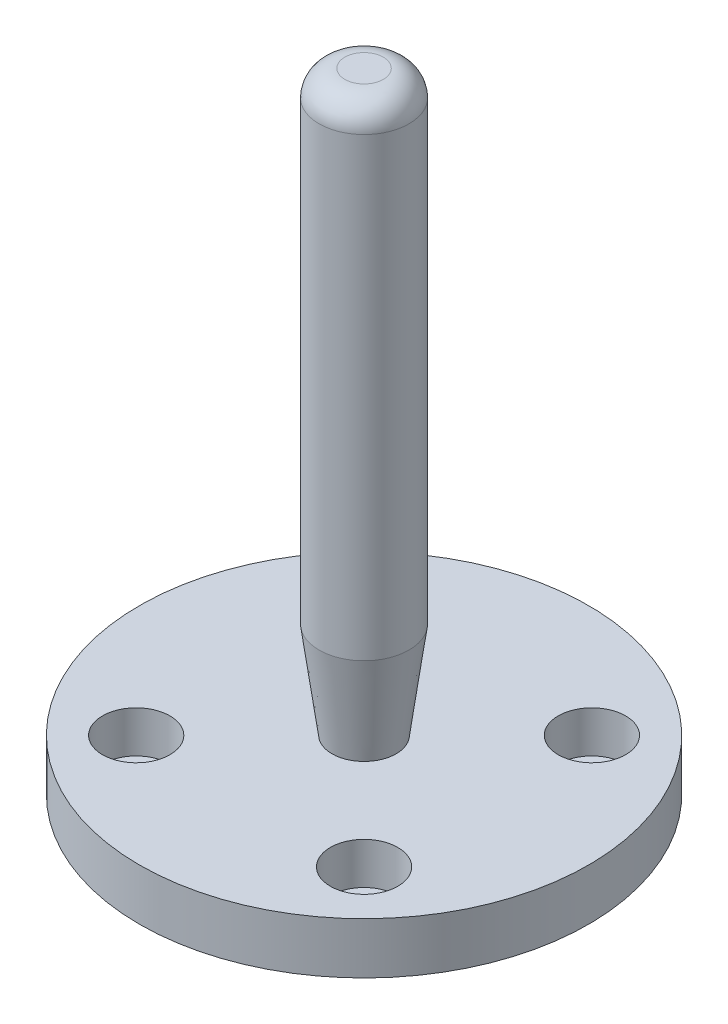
ISO-10303-21;
HEADER;
FILE_DESCRIPTION(('STEP AP214'),'2;1');
FILE_NAME('part.step','',(''),(''),'','','');
FILE_SCHEMA(('AUTOMOTIVE_DESIGN { 1 0 10303 214 1 1 1 1 }'));
ENDSEC;
DATA;
#1=APPLICATION_CONTEXT('core data for automotive mechanical design processes');
#2=APPLICATION_PROTOCOL_DEFINITION('international standard','automotive_design',2000,#1);
#3=PRODUCT_CONTEXT('',#1,'mechanical');
#4=PRODUCT('Part','Part','',(#3));
#5=PRODUCT_RELATED_PRODUCT_CATEGORY('part','',(#4));
#6=PRODUCT_DEFINITION_FORMATION('','',#4);
#7=PRODUCT_DEFINITION_CONTEXT('part definition',#1,'design');
#8=PRODUCT_DEFINITION('design','',#6,#7);
#9=PRODUCT_DEFINITION_SHAPE('','',#8);
#10=(LENGTH_UNIT() NAMED_UNIT(*) SI_UNIT(.MILLI.,.METRE.));
#11=(NAMED_UNIT(*) PLANE_ANGLE_UNIT() SI_UNIT($,.RADIAN.));
#12=(NAMED_UNIT(*) SI_UNIT($,.STERADIAN.) SOLID_ANGLE_UNIT());
#13=UNCERTAINTY_MEASURE_WITH_UNIT(LENGTH_MEASURE(1.E-05),#10,'distance_accuracy_value','');
#14=(GEOMETRIC_REPRESENTATION_CONTEXT(3) GLOBAL_UNCERTAINTY_ASSIGNED_CONTEXT((#13)) GLOBAL_UNIT_ASSIGNED_CONTEXT((#10,
#11,#12)) REPRESENTATION_CONTEXT('',''));
#15=CARTESIAN_POINT('',(0.,0.,0.));
#16=DIRECTION('',(0.,0.,1.));
#17=DIRECTION('',(1.,0.,0.));
#18=AXIS2_PLACEMENT_3D('',#15,#16,#17);
#19=CARTESIAN_POINT('',(0.,8.,0.));
#20=DIRECTION('',(0.,-1.,0.));
#21=DIRECTION('',(0.,0.,-1.));
#22=AXIS2_PLACEMENT_3D('',#19,#20,#21);
#23=CYLINDRICAL_SURFACE('',#22,35.);
#24=CARTESIAN_POINT('',(0.,8.,0.));
#25=DIRECTION('',(0.,1.,0.));
#26=DIRECTION('',(0.,0.,1.));
#27=AXIS2_PLACEMENT_3D('',#24,#25,#26);
#28=CIRCLE('',#27,35.);
#29=CARTESIAN_POINT('',(0.,8.,35.));
#30=VERTEX_POINT('',#29);
#31=EDGE_CURVE('E48',#30,#30,#28,.T.);
#32=ORIENTED_EDGE('',*,*,#31,.F.);
#33=EDGE_LOOP('',(#32));
#34=FACE_BOUND('',#33,.T.);
#35=CARTESIAN_POINT('',(0.,0.,0.));
#36=DIRECTION('',(0.,1.,0.));
#37=DIRECTION('',(0.,0.,1.));
#38=AXIS2_PLACEMENT_3D('',#35,#36,#37);
#39=CIRCLE('',#38,35.);
#40=CARTESIAN_POINT('',(0.,0.,35.));
#41=VERTEX_POINT('',#40);
#42=EDGE_CURVE('E51',#41,#41,#39,.T.);
#43=ORIENTED_EDGE('',*,*,#42,.T.);
#44=EDGE_LOOP('',(#43));
#45=FACE_BOUND('',#44,.T.);
#46=ADVANCED_FACE('F33',(#34,#45),#23,.T.);
#47=CARTESIAN_POINT('',(0.,8.,0.));
#48=DIRECTION('',(0.,1.,0.));
#49=DIRECTION('',(0.,0.,1.));
#50=AXIS2_PLACEMENT_3D('',#47,#48,#49);
#51=PLANE('',#50);
#52=CARTESIAN_POINT('',(0.,8.,0.));
#53=DIRECTION('',(0.,1.,0.));
#54=DIRECTION('',(0.,0.,1.));
#55=AXIS2_PLACEMENT_3D('',#52,#53,#54);
#56=CIRCLE('',#55,5.);
#57=CARTESIAN_POINT('',(0.,8.,5.));
#58=VERTEX_POINT('',#57);
#59=EDGE_CURVE('E44',#58,#58,#56,.T.);
#60=ORIENTED_EDGE('',*,*,#59,.F.);
#61=EDGE_LOOP('',(#60));
#62=FACE_BOUND('',#61,.T.);
#63=CARTESIAN_POINT('',(-17.75,8.,17.75));
#64=DIRECTION('',(0.,1.,0.));
#65=DIRECTION('',(0.,0.,1.));
#66=AXIS2_PLACEMENT_3D('',#63,#64,#65);
#67=CIRCLE('',#66,5.25);
#68=CARTESIAN_POINT('',(-17.75,8.,23.));
#69=VERTEX_POINT('',#68);
#70=EDGE_CURVE('E75',#69,#69,#67,.T.);
#71=ORIENTED_EDGE('',*,*,#70,.F.);
#72=EDGE_LOOP('',(#71));
#73=FACE_BOUND('',#72,.T.);
#74=CARTESIAN_POINT('',(17.75,8.,17.75));
#75=DIRECTION('',(0.,1.,0.));
#76=DIRECTION('',(0.,0.,1.));
#77=AXIS2_PLACEMENT_3D('',#74,#75,#76);
#78=CIRCLE('',#77,5.25);
#79=CARTESIAN_POINT('',(17.75,8.,23.));
#80=VERTEX_POINT('',#79);
#81=EDGE_CURVE('E69',#80,#80,#78,.T.);
#82=ORIENTED_EDGE('',*,*,#81,.F.);
#83=EDGE_LOOP('',(#82));
#84=FACE_BOUND('',#83,.T.);
#85=CARTESIAN_POINT('',(17.75,8.,-17.75));
#86=DIRECTION('',(0.,1.,0.));
#87=DIRECTION('',(0.,0.,1.));
#88=AXIS2_PLACEMENT_3D('',#85,#86,#87);
#89=CIRCLE('',#88,5.25);
#90=CARTESIAN_POINT('',(17.75,8.,-12.5));
#91=VERTEX_POINT('',#90);
#92=EDGE_CURVE('E63',#91,#91,#89,.T.);
#93=ORIENTED_EDGE('',*,*,#92,.F.);
#94=EDGE_LOOP('',(#93));
#95=FACE_BOUND('',#94,.T.);
#96=CARTESIAN_POINT('',(-17.75,8.,-17.75));
#97=DIRECTION('',(0.,1.,0.));
#98=DIRECTION('',(0.,0.,1.));
#99=AXIS2_PLACEMENT_3D('',#96,#97,#98);
#100=CIRCLE('',#99,5.25);
#101=CARTESIAN_POINT('',(-17.75,8.,-12.5));
#102=VERTEX_POINT('',#101);
#103=EDGE_CURVE('E57',#102,#102,#100,.T.);
#104=ORIENTED_EDGE('',*,*,#103,.F.);
#105=EDGE_LOOP('',(#104));
#106=FACE_BOUND('',#105,.T.);
#107=ORIENTED_EDGE('',*,*,#31,.T.);
#108=EDGE_LOOP('',(#107));
#109=FACE_BOUND('',#108,.T.);
#110=ADVANCED_FACE('F123',(#62,#73,#84,#95,#106,#109),#51,.T.);
#111=CARTESIAN_POINT('',(0.,0.,0.));
#112=DIRECTION('',(0.,1.,0.));
#113=DIRECTION('',(0.,0.,1.));
#114=AXIS2_PLACEMENT_3D('',#111,#112,#113);
#115=PLANE('',#114);
#116=CARTESIAN_POINT('',(17.75,0.,17.75));
#117=DIRECTION('',(0.,1.,0.));
#118=DIRECTION('',(0.,0.,1.));
#119=AXIS2_PLACEMENT_3D('',#116,#117,#118);
#120=CIRCLE('',#119,3.25);
#121=CARTESIAN_POINT('',(17.75,0.,21.));
#122=VERTEX_POINT('',#121);
#123=EDGE_CURVE('E98',#122,#122,#120,.T.);
#124=ORIENTED_EDGE('',*,*,#123,.T.);
#125=EDGE_LOOP('',(#124));
#126=FACE_BOUND('',#125,.T.);
#127=CARTESIAN_POINT('',(-17.75,0.,17.75));
#128=DIRECTION('',(0.,1.,0.));
#129=DIRECTION('',(0.,0.,1.));
#130=AXIS2_PLACEMENT_3D('',#127,#128,#129);
#131=CIRCLE('',#130,3.25);
#132=CARTESIAN_POINT('',(-17.75,0.,21.));
#133=VERTEX_POINT('',#132);
#134=EDGE_CURVE('E92',#133,#133,#131,.T.);
#135=ORIENTED_EDGE('',*,*,#134,.T.);
#136=EDGE_LOOP('',(#135));
#137=FACE_BOUND('',#136,.T.);
#138=CARTESIAN_POINT('',(-17.75,0.,-17.75));
#139=DIRECTION('',(0.,1.,0.));
#140=DIRECTION('',(0.,0.,1.));
#141=AXIS2_PLACEMENT_3D('',#138,#139,#140);
#142=CIRCLE('',#141,3.25);
#143=CARTESIAN_POINT('',(-17.75,0.,-14.5));
#144=VERTEX_POINT('',#143);
#145=EDGE_CURVE('E86',#144,#144,#142,.T.);
#146=ORIENTED_EDGE('',*,*,#145,.T.);
#147=EDGE_LOOP('',(#146));
#148=FACE_BOUND('',#147,.T.);
#149=CARTESIAN_POINT('',(17.75,0.,-17.75));
#150=DIRECTION('',(0.,1.,0.));
#151=DIRECTION('',(0.,0.,1.));
#152=AXIS2_PLACEMENT_3D('',#149,#150,#151);
#153=CIRCLE('',#152,3.25);
#154=CARTESIAN_POINT('',(17.75,0.,-14.5));
#155=VERTEX_POINT('',#154);
#156=EDGE_CURVE('E78',#155,#155,#153,.T.);
#157=ORIENTED_EDGE('',*,*,#156,.T.);
#158=EDGE_LOOP('',(#157));
#159=FACE_BOUND('',#158,.T.);
#160=ORIENTED_EDGE('',*,*,#42,.F.);
#161=EDGE_LOOP('',(#160));
#162=FACE_BOUND('',#161,.T.);
#163=ADVANCED_FACE('F129',(#126,#137,#148,#159,#162),#115,.F.);
#164=CARTESIAN_POINT('',(-17.75,1.5,-17.75));
#165=DIRECTION('',(0.,1.,0.));
#166=DIRECTION('',(0.,0.,1.));
#167=AXIS2_PLACEMENT_3D('',#164,#165,#166);
#168=CYLINDRICAL_SURFACE('',#167,5.25);
#169=CARTESIAN_POINT('',(-17.75,1.5,-17.75));
#170=DIRECTION('',(0.,1.,0.));
#171=DIRECTION('',(0.,0.,1.));
#172=AXIS2_PLACEMENT_3D('',#169,#170,#171);
#173=CIRCLE('',#172,5.25);
#174=CARTESIAN_POINT('',(-17.75,1.5,-12.5));
#175=VERTEX_POINT('',#174);
#176=EDGE_CURVE('E54',#175,#175,#173,.T.);
#177=CARTESIAN_POINT('',(-17.75,1.5,-12.5));
#178=CARTESIAN_POINT('',(-17.75,1.56770833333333,-12.5));
#179=CARTESIAN_POINT('',(-17.75,1.63541666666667,-12.5));
#180=CARTESIAN_POINT('',(-17.75,1.77083333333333,-12.5));
#181=CARTESIAN_POINT('',(-17.75,1.83854166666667,-12.5));
#182=CARTESIAN_POINT('',(-17.75,1.97395833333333,-12.5));
#183=CARTESIAN_POINT('',(-17.75,2.04166666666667,-12.5));
#184=CARTESIAN_POINT('',(-17.75,2.17708333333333,-12.5));
#185=CARTESIAN_POINT('',(-17.75,2.24479166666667,-12.5));
#186=CARTESIAN_POINT('',(-17.75,2.38020833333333,-12.5));
#187=CARTESIAN_POINT('',(-17.75,2.44791666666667,-12.5));
#188=CARTESIAN_POINT('',(-17.75,2.58333333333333,-12.5));
#189=CARTESIAN_POINT('',(-17.75,2.65104166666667,-12.5));
#190=CARTESIAN_POINT('',(-17.75,2.78645833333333,-12.5));
#191=CARTESIAN_POINT('',(-17.75,2.85416666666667,-12.5));
#192=CARTESIAN_POINT('',(-17.75,2.98958333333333,-12.5));
#193=CARTESIAN_POINT('',(-17.75,3.05729166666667,-12.5));
#194=CARTESIAN_POINT('',(-17.75,3.19270833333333,-12.5));
#195=CARTESIAN_POINT('',(-17.75,3.26041666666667,-12.5));
#196=CARTESIAN_POINT('',(-17.75,3.39583333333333,-12.5));
#197=CARTESIAN_POINT('',(-17.75,3.46354166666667,-12.5));
#198=CARTESIAN_POINT('',(-17.75,3.59895833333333,-12.5));
#199=CARTESIAN_POINT('',(-17.75,3.66666666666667,-12.5));
#200=CARTESIAN_POINT('',(-17.75,3.80208333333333,-12.5));
#201=CARTESIAN_POINT('',(-17.75,3.86979166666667,-12.5));
#202=CARTESIAN_POINT('',(-17.75,4.00520833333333,-12.5));
#203=CARTESIAN_POINT('',(-17.75,4.07291666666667,-12.5));
#204=CARTESIAN_POINT('',(-17.75,4.20833333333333,-12.5));
#205=CARTESIAN_POINT('',(-17.75,4.27604166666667,-12.5));
#206=CARTESIAN_POINT('',(-17.75,4.41145833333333,-12.5));
#207=CARTESIAN_POINT('',(-17.75,4.47916666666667,-12.5));
#208=CARTESIAN_POINT('',(-17.75,4.61458333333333,-12.5));
#209=CARTESIAN_POINT('',(-17.75,4.68229166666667,-12.5));
#210=CARTESIAN_POINT('',(-17.75,4.81770833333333,-12.5));
#211=CARTESIAN_POINT('',(-17.75,4.88541666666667,-12.5));
#212=CARTESIAN_POINT('',(-17.75,5.02083333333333,-12.5));
#213=CARTESIAN_POINT('',(-17.75,5.08854166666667,-12.5));
#214=CARTESIAN_POINT('',(-17.75,5.22395833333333,-12.5));
#215=CARTESIAN_POINT('',(-17.75,5.29166666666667,-12.5));
#216=CARTESIAN_POINT('',(-17.75,5.42708333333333,-12.5));
#217=CARTESIAN_POINT('',(-17.75,5.49479166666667,-12.5));
#218=CARTESIAN_POINT('',(-17.75,5.63020833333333,-12.5));
#219=CARTESIAN_POINT('',(-17.75,5.69791666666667,-12.5));
#220=CARTESIAN_POINT('',(-17.75,5.83333333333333,-12.5));
#221=CARTESIAN_POINT('',(-17.75,5.90104166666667,-12.5));
#222=CARTESIAN_POINT('',(-17.75,6.03645833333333,-12.5));
#223=CARTESIAN_POINT('',(-17.75,6.10416666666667,-12.5));
#224=CARTESIAN_POINT('',(-17.75,6.23958333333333,-12.5));
#225=CARTESIAN_POINT('',(-17.75,6.30729166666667,-12.5));
#226=CARTESIAN_POINT('',(-17.75,6.44270833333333,-12.5));
#227=CARTESIAN_POINT('',(-17.75,6.51041666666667,-12.5));
#228=CARTESIAN_POINT('',(-17.75,6.64583333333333,-12.5));
#229=CARTESIAN_POINT('',(-17.75,6.71354166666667,-12.5));
#230=CARTESIAN_POINT('',(-17.75,6.84895833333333,-12.5));
#231=CARTESIAN_POINT('',(-17.75,6.91666666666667,-12.5));
#232=CARTESIAN_POINT('',(-17.75,7.05208333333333,-12.5));
#233=CARTESIAN_POINT('',(-17.75,7.11979166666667,-12.5));
#234=CARTESIAN_POINT('',(-17.75,7.25520833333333,-12.5));
#235=CARTESIAN_POINT('',(-17.75,7.32291666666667,-12.5));
#236=CARTESIAN_POINT('',(-17.75,7.45833333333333,-12.5));
#237=CARTESIAN_POINT('',(-17.75,7.52604166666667,-12.5));
#238=CARTESIAN_POINT('',(-17.75,7.66145833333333,-12.5));
#239=CARTESIAN_POINT('',(-17.75,7.72916666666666,-12.5));
#240=CARTESIAN_POINT('',(-17.75,7.86458333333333,-12.5));
#241=CARTESIAN_POINT('',(-17.75,7.93229166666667,-12.5));
#242=CARTESIAN_POINT('',(-17.75,8.,-12.5));
#243=B_SPLINE_CURVE_WITH_KNOTS('',3,(#177,#178,#179,#180,#181,#182,#183,#184,#185,#186,#187,
#188,#189,#190,#191,#192,#193,#194,#195,#196,#197,#198,#199,#200,#201,#202,#203,#204,#205,#206,
#207,#208,#209,#210,#211,#212,#213,#214,#215,#216,#217,#218,#219,#220,#221,#222,#223,#224,#225,
#226,#227,#228,#229,#230,#231,#232,#233,#234,#235,#236,#237,#238,#239,#240,#241,#242),
.UNSPECIFIED.,.F.,.F.,(4,2,2,2,2,2,2,2,2,2,2,2,2,2,2,2,2,2,2,2,2,2,2,2,2,2,2,2,2,2,2,2,4),(0.,
0.203125,0.40625,0.609375,0.8125,1.015625,1.21875,1.421875,1.625,1.828125,2.03125,2.234375,
2.4375,2.640625,2.84375,3.046875,3.25,3.453125,3.65625,3.859375,4.0625,4.265625,4.46875,
4.671875,4.875,5.078125,5.28125,5.484375,5.6875,5.890625,6.09375,6.296875,6.5),.UNSPECIFIED.);
#244=EDGE_CURVE('BSEAM136',#175,#102,#243,.T.);
#245=ORIENTED_EDGE('',*,*,#176,.F.);
#246=ORIENTED_EDGE('',*,*,#103,.T.);
#247=ORIENTED_EDGE('',*,*,#244,.T.);
#248=ORIENTED_EDGE('',*,*,#244,.F.);
#249=EDGE_LOOP('',(#245,#247,#246,#248));
#250=FACE_BOUND('',#249,.T.);
#251=ADVANCED_FACE('F136',(#250),#168,.F.);
#252=CARTESIAN_POINT('',(-17.75,1.5,-17.75));
#253=DIRECTION('',(0.,1.,0.));
#254=DIRECTION('',(0.,0.,1.));
#255=AXIS2_PLACEMENT_3D('',#252,#253,#254);
#256=PLANE('',#255);
#257=CARTESIAN_POINT('',(-17.75,1.5,-17.75));
#258=DIRECTION('',(0.,1.,0.));
#259=DIRECTION('',(0.,0.,1.));
#260=AXIS2_PLACEMENT_3D('',#257,#258,#259);
#261=CIRCLE('',#260,3.25);
#262=CARTESIAN_POINT('',(-17.75,1.5,-14.5));
#263=VERTEX_POINT('',#262);
#264=EDGE_CURVE('E89',#263,#263,#261,.T.);
#265=ORIENTED_EDGE('',*,*,#264,.F.);
#266=EDGE_LOOP('',(#265));
#267=FACE_BOUND('',#266,.T.);
#268=ORIENTED_EDGE('',*,*,#176,.T.);
#269=EDGE_LOOP('',(#268));
#270=FACE_BOUND('',#269,.T.);
#271=ADVANCED_FACE('F141',(#267,#270),#256,.T.);
#272=CARTESIAN_POINT('',(17.75,1.5,-17.75));
#273=DIRECTION('',(0.,1.,0.));
#274=DIRECTION('',(0.,0.,1.));
#275=AXIS2_PLACEMENT_3D('',#272,#273,#274);
#276=CYLINDRICAL_SURFACE('',#275,5.25);
#277=CARTESIAN_POINT('',(17.75,1.5,-17.75));
#278=DIRECTION('',(0.,1.,0.));
#279=DIRECTION('',(0.,0.,1.));
#280=AXIS2_PLACEMENT_3D('',#277,#278,#279);
#281=CIRCLE('',#280,5.25);
#282=CARTESIAN_POINT('',(17.75,1.5,-12.5));
#283=VERTEX_POINT('',#282);
#284=EDGE_CURVE('E60',#283,#283,#281,.T.);
#285=CARTESIAN_POINT('',(17.75,1.5,-12.5));
#286=CARTESIAN_POINT('',(17.75,1.56770833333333,-12.5));
#287=CARTESIAN_POINT('',(17.75,1.63541666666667,-12.5));
#288=CARTESIAN_POINT('',(17.75,1.77083333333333,-12.5));
#289=CARTESIAN_POINT('',(17.75,1.83854166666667,-12.5));
#290=CARTESIAN_POINT('',(17.75,1.97395833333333,-12.5));
#291=CARTESIAN_POINT('',(17.75,2.04166666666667,-12.5));
#292=CARTESIAN_POINT('',(17.75,2.17708333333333,-12.5));
#293=CARTESIAN_POINT('',(17.75,2.24479166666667,-12.5));
#294=CARTESIAN_POINT('',(17.75,2.38020833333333,-12.5));
#295=CARTESIAN_POINT('',(17.75,2.44791666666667,-12.5));
#296=CARTESIAN_POINT('',(17.75,2.58333333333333,-12.5));
#297=CARTESIAN_POINT('',(17.75,2.65104166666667,-12.5));
#298=CARTESIAN_POINT('',(17.75,2.78645833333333,-12.5));
#299=CARTESIAN_POINT('',(17.75,2.85416666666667,-12.5));
#300=CARTESIAN_POINT('',(17.75,2.98958333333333,-12.5));
#301=CARTESIAN_POINT('',(17.75,3.05729166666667,-12.5));
#302=CARTESIAN_POINT('',(17.75,3.19270833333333,-12.5));
#303=CARTESIAN_POINT('',(17.75,3.26041666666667,-12.5));
#304=CARTESIAN_POINT('',(17.75,3.39583333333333,-12.5));
#305=CARTESIAN_POINT('',(17.75,3.46354166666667,-12.5));
#306=CARTESIAN_POINT('',(17.75,3.59895833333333,-12.5));
#307=CARTESIAN_POINT('',(17.75,3.66666666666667,-12.5));
#308=CARTESIAN_POINT('',(17.75,3.80208333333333,-12.5));
#309=CARTESIAN_POINT('',(17.75,3.86979166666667,-12.5));
#310=CARTESIAN_POINT('',(17.75,4.00520833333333,-12.5));
#311=CARTESIAN_POINT('',(17.75,4.07291666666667,-12.5));
#312=CARTESIAN_POINT('',(17.75,4.20833333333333,-12.5));
#313=CARTESIAN_POINT('',(17.75,4.27604166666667,-12.5));
#314=CARTESIAN_POINT('',(17.75,4.41145833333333,-12.5));
#315=CARTESIAN_POINT('',(17.75,4.47916666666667,-12.5));
#316=CARTESIAN_POINT('',(17.75,4.61458333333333,-12.5));
#317=CARTESIAN_POINT('',(17.75,4.68229166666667,-12.5));
#318=CARTESIAN_POINT('',(17.75,4.81770833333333,-12.5));
#319=CARTESIAN_POINT('',(17.75,4.88541666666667,-12.5));
#320=CARTESIAN_POINT('',(17.75,5.02083333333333,-12.5));
#321=CARTESIAN_POINT('',(17.75,5.08854166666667,-12.5));
#322=CARTESIAN_POINT('',(17.75,5.22395833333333,-12.5));
#323=CARTESIAN_POINT('',(17.75,5.29166666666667,-12.5));
#324=CARTESIAN_POINT('',(17.75,5.42708333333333,-12.5));
#325=CARTESIAN_POINT('',(17.75,5.49479166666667,-12.5));
#326=CARTESIAN_POINT('',(17.75,5.63020833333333,-12.5));
#327=CARTESIAN_POINT('',(17.75,5.69791666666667,-12.5));
#328=CARTESIAN_POINT('',(17.75,5.83333333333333,-12.5));
#329=CARTESIAN_POINT('',(17.75,5.90104166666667,-12.5));
#330=CARTESIAN_POINT('',(17.75,6.03645833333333,-12.5));
#331=CARTESIAN_POINT('',(17.75,6.10416666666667,-12.5));
#332=CARTESIAN_POINT('',(17.75,6.23958333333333,-12.5));
#333=CARTESIAN_POINT('',(17.75,6.30729166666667,-12.5));
#334=CARTESIAN_POINT('',(17.75,6.44270833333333,-12.5));
#335=CARTESIAN_POINT('',(17.75,6.51041666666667,-12.5));
#336=CARTESIAN_POINT('',(17.75,6.64583333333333,-12.5));
#337=CARTESIAN_POINT('',(17.75,6.71354166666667,-12.5));
#338=CARTESIAN_POINT('',(17.75,6.84895833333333,-12.5));
#339=CARTESIAN_POINT('',(17.75,6.91666666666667,-12.5));
#340=CARTESIAN_POINT('',(17.75,7.05208333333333,-12.5));
#341=CARTESIAN_POINT('',(17.75,7.11979166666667,-12.5));
#342=CARTESIAN_POINT('',(17.75,7.25520833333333,-12.5));
#343=CARTESIAN_POINT('',(17.75,7.32291666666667,-12.5));
#344=CARTESIAN_POINT('',(17.75,7.45833333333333,-12.5));
#345=CARTESIAN_POINT('',(17.75,7.52604166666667,-12.5));
#346=CARTESIAN_POINT('',(17.75,7.66145833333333,-12.5));
#347=CARTESIAN_POINT('',(17.75,7.72916666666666,-12.5));
#348=CARTESIAN_POINT('',(17.75,7.86458333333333,-12.5));
#349=CARTESIAN_POINT('',(17.75,7.93229166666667,-12.5));
#350=CARTESIAN_POINT('',(17.75,8.,-12.5));
#351=B_SPLINE_CURVE_WITH_KNOTS('',3,(#285,#286,#287,#288,#289,#290,#291,#292,#293,#294,#295,
#296,#297,#298,#299,#300,#301,#302,#303,#304,#305,#306,#307,#308,#309,#310,#311,#312,#313,#314,
#315,#316,#317,#318,#319,#320,#321,#322,#323,#324,#325,#326,#327,#328,#329,#330,#331,#332,#333,
#334,#335,#336,#337,#338,#339,#340,#341,#342,#343,#344,#345,#346,#347,#348,#349,#350),
.UNSPECIFIED.,.F.,.F.,(4,2,2,2,2,2,2,2,2,2,2,2,2,2,2,2,2,2,2,2,2,2,2,2,2,2,2,2,2,2,2,2,4),(0.,
0.203125,0.40625,0.609375,0.8125,1.015625,1.21875,1.421875,1.625,1.828125,2.03125,2.234375,
2.4375,2.640625,2.84375,3.046875,3.25,3.453125,3.65625,3.859375,4.0625,4.265625,4.46875,
4.671875,4.875,5.078125,5.28125,5.484375,5.6875,5.890625,6.09375,6.296875,6.5),.UNSPECIFIED.);
#352=EDGE_CURVE('BSEAM145',#283,#91,#351,.T.);
#353=ORIENTED_EDGE('',*,*,#284,.F.);
#354=ORIENTED_EDGE('',*,*,#92,.T.);
#355=ORIENTED_EDGE('',*,*,#352,.T.);
#356=ORIENTED_EDGE('',*,*,#352,.F.);
#357=EDGE_LOOP('',(#353,#355,#354,#356));
#358=FACE_BOUND('',#357,.T.);
#359=ADVANCED_FACE('F145',(#358),#276,.F.);
#360=CARTESIAN_POINT('',(17.75,1.5,-17.75));
#361=DIRECTION('',(0.,1.,0.));
#362=DIRECTION('',(0.,0.,1.));
#363=AXIS2_PLACEMENT_3D('',#360,#361,#362);
#364=PLANE('',#363);
#365=CARTESIAN_POINT('',(17.75,1.5,-17.75));
#366=DIRECTION('',(0.,1.,0.));
#367=DIRECTION('',(0.,0.,1.));
#368=AXIS2_PLACEMENT_3D('',#365,#366,#367);
#369=CIRCLE('',#368,3.25);
#370=CARTESIAN_POINT('',(17.75,1.5,-14.5));
#371=VERTEX_POINT('',#370);
#372=EDGE_CURVE('E83',#371,#371,#369,.T.);
#373=ORIENTED_EDGE('',*,*,#372,.F.);
#374=EDGE_LOOP('',(#373));
#375=FACE_BOUND('',#374,.T.);
#376=ORIENTED_EDGE('',*,*,#284,.T.);
#377=EDGE_LOOP('',(#376));
#378=FACE_BOUND('',#377,.T.);
#379=ADVANCED_FACE('F149',(#375,#378),#364,.T.);
#380=CARTESIAN_POINT('',(17.75,1.5,17.75));
#381=DIRECTION('',(0.,1.,0.));
#382=DIRECTION('',(0.,0.,1.));
#383=AXIS2_PLACEMENT_3D('',#380,#381,#382);
#384=CYLINDRICAL_SURFACE('',#383,5.25);
#385=CARTESIAN_POINT('',(17.75,1.5,17.75));
#386=DIRECTION('',(0.,1.,0.));
#387=DIRECTION('',(0.,0.,1.));
#388=AXIS2_PLACEMENT_3D('',#385,#386,#387);
#389=CIRCLE('',#388,5.25);
#390=CARTESIAN_POINT('',(17.75,1.5,23.));
#391=VERTEX_POINT('',#390);
#392=EDGE_CURVE('E66',#391,#391,#389,.T.);
#393=CARTESIAN_POINT('',(17.75,1.5,23.));
#394=CARTESIAN_POINT('',(17.75,1.56770833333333,23.));
#395=CARTESIAN_POINT('',(17.75,1.63541666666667,23.));
#396=CARTESIAN_POINT('',(17.75,1.77083333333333,23.));
#397=CARTESIAN_POINT('',(17.75,1.83854166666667,23.));
#398=CARTESIAN_POINT('',(17.75,1.97395833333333,23.));
#399=CARTESIAN_POINT('',(17.75,2.04166666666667,23.));
#400=CARTESIAN_POINT('',(17.75,2.17708333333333,23.));
#401=CARTESIAN_POINT('',(17.75,2.24479166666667,23.));
#402=CARTESIAN_POINT('',(17.75,2.38020833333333,23.));
#403=CARTESIAN_POINT('',(17.75,2.44791666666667,23.));
#404=CARTESIAN_POINT('',(17.75,2.58333333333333,23.));
#405=CARTESIAN_POINT('',(17.75,2.65104166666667,23.));
#406=CARTESIAN_POINT('',(17.75,2.78645833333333,23.));
#407=CARTESIAN_POINT('',(17.75,2.85416666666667,23.));
#408=CARTESIAN_POINT('',(17.75,2.98958333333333,23.));
#409=CARTESIAN_POINT('',(17.75,3.05729166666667,23.));
#410=CARTESIAN_POINT('',(17.75,3.19270833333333,23.));
#411=CARTESIAN_POINT('',(17.75,3.26041666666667,23.));
#412=CARTESIAN_POINT('',(17.75,3.39583333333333,23.));
#413=CARTESIAN_POINT('',(17.75,3.46354166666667,23.));
#414=CARTESIAN_POINT('',(17.75,3.59895833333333,23.));
#415=CARTESIAN_POINT('',(17.75,3.66666666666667,23.));
#416=CARTESIAN_POINT('',(17.75,3.80208333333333,23.));
#417=CARTESIAN_POINT('',(17.75,3.86979166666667,23.));
#418=CARTESIAN_POINT('',(17.75,4.00520833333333,23.));
#419=CARTESIAN_POINT('',(17.75,4.07291666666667,23.));
#420=CARTESIAN_POINT('',(17.75,4.20833333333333,23.));
#421=CARTESIAN_POINT('',(17.75,4.27604166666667,23.));
#422=CARTESIAN_POINT('',(17.75,4.41145833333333,23.));
#423=CARTESIAN_POINT('',(17.75,4.47916666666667,23.));
#424=CARTESIAN_POINT('',(17.75,4.61458333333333,23.));
#425=CARTESIAN_POINT('',(17.75,4.68229166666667,23.));
#426=CARTESIAN_POINT('',(17.75,4.81770833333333,23.));
#427=CARTESIAN_POINT('',(17.75,4.88541666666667,23.));
#428=CARTESIAN_POINT('',(17.75,5.02083333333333,23.));
#429=CARTESIAN_POINT('',(17.75,5.08854166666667,23.));
#430=CARTESIAN_POINT('',(17.75,5.22395833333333,23.));
#431=CARTESIAN_POINT('',(17.75,5.29166666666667,23.));
#432=CARTESIAN_POINT('',(17.75,5.42708333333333,23.));
#433=CARTESIAN_POINT('',(17.75,5.49479166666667,23.));
#434=CARTESIAN_POINT('',(17.75,5.63020833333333,23.));
#435=CARTESIAN_POINT('',(17.75,5.69791666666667,23.));
#436=CARTESIAN_POINT('',(17.75,5.83333333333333,23.));
#437=CARTESIAN_POINT('',(17.75,5.90104166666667,23.));
#438=CARTESIAN_POINT('',(17.75,6.03645833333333,23.));
#439=CARTESIAN_POINT('',(17.75,6.10416666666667,23.));
#440=CARTESIAN_POINT('',(17.75,6.23958333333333,23.));
#441=CARTESIAN_POINT('',(17.75,6.30729166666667,23.));
#442=CARTESIAN_POINT('',(17.75,6.44270833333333,23.));
#443=CARTESIAN_POINT('',(17.75,6.51041666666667,23.));
#444=CARTESIAN_POINT('',(17.75,6.64583333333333,23.));
#445=CARTESIAN_POINT('',(17.75,6.71354166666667,23.));
#446=CARTESIAN_POINT('',(17.75,6.84895833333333,23.));
#447=CARTESIAN_POINT('',(17.75,6.91666666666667,23.));
#448=CARTESIAN_POINT('',(17.75,7.05208333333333,23.));
#449=CARTESIAN_POINT('',(17.75,7.11979166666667,23.));
#450=CARTESIAN_POINT('',(17.75,7.25520833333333,23.));
#451=CARTESIAN_POINT('',(17.75,7.32291666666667,23.));
#452=CARTESIAN_POINT('',(17.75,7.45833333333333,23.));
#453=CARTESIAN_POINT('',(17.75,7.52604166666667,23.));
#454=CARTESIAN_POINT('',(17.75,7.66145833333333,23.));
#455=CARTESIAN_POINT('',(17.75,7.72916666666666,23.));
#456=CARTESIAN_POINT('',(17.75,7.86458333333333,23.));
#457=CARTESIAN_POINT('',(17.75,7.93229166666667,23.));
#458=CARTESIAN_POINT('',(17.75,8.,23.));
#459=B_SPLINE_CURVE_WITH_KNOTS('',3,(#393,#394,#395,#396,#397,#398,#399,#400,#401,#402,#403,
#404,#405,#406,#407,#408,#409,#410,#411,#412,#413,#414,#415,#416,#417,#418,#419,#420,#421,#422,
#423,#424,#425,#426,#427,#428,#429,#430,#431,#432,#433,#434,#435,#436,#437,#438,#439,#440,#441,
#442,#443,#444,#445,#446,#447,#448,#449,#450,#451,#452,#453,#454,#455,#456,#457,#458),
.UNSPECIFIED.,.F.,.F.,(4,2,2,2,2,2,2,2,2,2,2,2,2,2,2,2,2,2,2,2,2,2,2,2,2,2,2,2,2,2,2,2,4),(0.,
0.203125,0.40625,0.609375,0.8125,1.015625,1.21875,1.421875,1.625,1.828125,2.03125,2.234375,
2.4375,2.640625,2.84375,3.046875,3.25,3.453125,3.65625,3.859375,4.0625,4.265625,4.46875,
4.671875,4.875,5.078125,5.28125,5.484375,5.6875,5.890625,6.09375,6.296875,6.5),.UNSPECIFIED.);
#460=EDGE_CURVE('BSEAM153',#391,#80,#459,.T.);
#461=ORIENTED_EDGE('',*,*,#392,.F.);
#462=ORIENTED_EDGE('',*,*,#81,.T.);
#463=ORIENTED_EDGE('',*,*,#460,.T.);
#464=ORIENTED_EDGE('',*,*,#460,.F.);
#465=EDGE_LOOP('',(#461,#463,#462,#464));
#466=FACE_BOUND('',#465,.T.);
#467=ADVANCED_FACE('F153',(#466),#384,.F.);
#468=CARTESIAN_POINT('',(17.75,1.5,17.75));
#469=DIRECTION('',(0.,1.,0.));
#470=DIRECTION('',(0.,0.,1.));
#471=AXIS2_PLACEMENT_3D('',#468,#469,#470);
#472=PLANE('',#471);
#473=CARTESIAN_POINT('',(17.75,1.5,17.75));
#474=DIRECTION('',(0.,1.,0.));
#475=DIRECTION('',(0.,0.,1.));
#476=AXIS2_PLACEMENT_3D('',#473,#474,#475);
#477=CIRCLE('',#476,3.25);
#478=CARTESIAN_POINT('',(17.75,1.5,21.));
#479=VERTEX_POINT('',#478);
#480=EDGE_CURVE('E101',#479,#479,#477,.T.);
#481=ORIENTED_EDGE('',*,*,#480,.F.);
#482=EDGE_LOOP('',(#481));
#483=FACE_BOUND('',#482,.T.);
#484=ORIENTED_EDGE('',*,*,#392,.T.);
#485=EDGE_LOOP('',(#484));
#486=FACE_BOUND('',#485,.T.);
#487=ADVANCED_FACE('F157',(#483,#486),#472,.T.);
#488=CARTESIAN_POINT('',(-17.75,1.5,17.75));
#489=DIRECTION('',(0.,1.,0.));
#490=DIRECTION('',(0.,0.,1.));
#491=AXIS2_PLACEMENT_3D('',#488,#489,#490);
#492=CYLINDRICAL_SURFACE('',#491,5.25);
#493=CARTESIAN_POINT('',(-17.75,1.5,17.75));
#494=DIRECTION('',(0.,1.,0.));
#495=DIRECTION('',(0.,0.,1.));
#496=AXIS2_PLACEMENT_3D('',#493,#494,#495);
#497=CIRCLE('',#496,5.25);
#498=CARTESIAN_POINT('',(-17.75,1.5,23.));
#499=VERTEX_POINT('',#498);
#500=EDGE_CURVE('E72',#499,#499,#497,.T.);
#501=CARTESIAN_POINT('',(-17.75,1.5,23.));
#502=CARTESIAN_POINT('',(-17.75,1.56770833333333,23.));
#503=CARTESIAN_POINT('',(-17.75,1.63541666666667,23.));
#504=CARTESIAN_POINT('',(-17.75,1.77083333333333,23.));
#505=CARTESIAN_POINT('',(-17.75,1.83854166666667,23.));
#506=CARTESIAN_POINT('',(-17.75,1.97395833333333,23.));
#507=CARTESIAN_POINT('',(-17.75,2.04166666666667,23.));
#508=CARTESIAN_POINT('',(-17.75,2.17708333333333,23.));
#509=CARTESIAN_POINT('',(-17.75,2.24479166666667,23.));
#510=CARTESIAN_POINT('',(-17.75,2.38020833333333,23.));
#511=CARTESIAN_POINT('',(-17.75,2.44791666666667,23.));
#512=CARTESIAN_POINT('',(-17.75,2.58333333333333,23.));
#513=CARTESIAN_POINT('',(-17.75,2.65104166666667,23.));
#514=CARTESIAN_POINT('',(-17.75,2.78645833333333,23.));
#515=CARTESIAN_POINT('',(-17.75,2.85416666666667,23.));
#516=CARTESIAN_POINT('',(-17.75,2.98958333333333,23.));
#517=CARTESIAN_POINT('',(-17.75,3.05729166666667,23.));
#518=CARTESIAN_POINT('',(-17.75,3.19270833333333,23.));
#519=CARTESIAN_POINT('',(-17.75,3.26041666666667,23.));
#520=CARTESIAN_POINT('',(-17.75,3.39583333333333,23.));
#521=CARTESIAN_POINT('',(-17.75,3.46354166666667,23.));
#522=CARTESIAN_POINT('',(-17.75,3.59895833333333,23.));
#523=CARTESIAN_POINT('',(-17.75,3.66666666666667,23.));
#524=CARTESIAN_POINT('',(-17.75,3.80208333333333,23.));
#525=CARTESIAN_POINT('',(-17.75,3.86979166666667,23.));
#526=CARTESIAN_POINT('',(-17.75,4.00520833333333,23.));
#527=CARTESIAN_POINT('',(-17.75,4.07291666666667,23.));
#528=CARTESIAN_POINT('',(-17.75,4.20833333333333,23.));
#529=CARTESIAN_POINT('',(-17.75,4.27604166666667,23.));
#530=CARTESIAN_POINT('',(-17.75,4.41145833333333,23.));
#531=CARTESIAN_POINT('',(-17.75,4.47916666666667,23.));
#532=CARTESIAN_POINT('',(-17.75,4.61458333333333,23.));
#533=CARTESIAN_POINT('',(-17.75,4.68229166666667,23.));
#534=CARTESIAN_POINT('',(-17.75,4.81770833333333,23.));
#535=CARTESIAN_POINT('',(-17.75,4.88541666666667,23.));
#536=CARTESIAN_POINT('',(-17.75,5.02083333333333,23.));
#537=CARTESIAN_POINT('',(-17.75,5.08854166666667,23.));
#538=CARTESIAN_POINT('',(-17.75,5.22395833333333,23.));
#539=CARTESIAN_POINT('',(-17.75,5.29166666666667,23.));
#540=CARTESIAN_POINT('',(-17.75,5.42708333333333,23.));
#541=CARTESIAN_POINT('',(-17.75,5.49479166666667,23.));
#542=CARTESIAN_POINT('',(-17.75,5.63020833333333,23.));
#543=CARTESIAN_POINT('',(-17.75,5.69791666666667,23.));
#544=CARTESIAN_POINT('',(-17.75,5.83333333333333,23.));
#545=CARTESIAN_POINT('',(-17.75,5.90104166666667,23.));
#546=CARTESIAN_POINT('',(-17.75,6.03645833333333,23.));
#547=CARTESIAN_POINT('',(-17.75,6.10416666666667,23.));
#548=CARTESIAN_POINT('',(-17.75,6.23958333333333,23.));
#549=CARTESIAN_POINT('',(-17.75,6.30729166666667,23.));
#550=CARTESIAN_POINT('',(-17.75,6.44270833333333,23.));
#551=CARTESIAN_POINT('',(-17.75,6.51041666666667,23.));
#552=CARTESIAN_POINT('',(-17.75,6.64583333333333,23.));
#553=CARTESIAN_POINT('',(-17.75,6.71354166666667,23.));
#554=CARTESIAN_POINT('',(-17.75,6.84895833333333,23.));
#555=CARTESIAN_POINT('',(-17.75,6.91666666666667,23.));
#556=CARTESIAN_POINT('',(-17.75,7.05208333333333,23.));
#557=CARTESIAN_POINT('',(-17.75,7.11979166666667,23.));
#558=CARTESIAN_POINT('',(-17.75,7.25520833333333,23.));
#559=CARTESIAN_POINT('',(-17.75,7.32291666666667,23.));
#560=CARTESIAN_POINT('',(-17.75,7.45833333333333,23.));
#561=CARTESIAN_POINT('',(-17.75,7.52604166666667,23.));
#562=CARTESIAN_POINT('',(-17.75,7.66145833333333,23.));
#563=CARTESIAN_POINT('',(-17.75,7.72916666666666,23.));
#564=CARTESIAN_POINT('',(-17.75,7.86458333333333,23.));
#565=CARTESIAN_POINT('',(-17.75,7.93229166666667,23.));
#566=CARTESIAN_POINT('',(-17.75,8.,23.));
#567=B_SPLINE_CURVE_WITH_KNOTS('',3,(#501,#502,#503,#504,#505,#506,#507,#508,#509,#510,#511,
#512,#513,#514,#515,#516,#517,#518,#519,#520,#521,#522,#523,#524,#525,#526,#527,#528,#529,#530,
#531,#532,#533,#534,#535,#536,#537,#538,#539,#540,#541,#542,#543,#544,#545,#546,#547,#548,#549,
#550,#551,#552,#553,#554,#555,#556,#557,#558,#559,#560,#561,#562,#563,#564,#565,#566),
.UNSPECIFIED.,.F.,.F.,(4,2,2,2,2,2,2,2,2,2,2,2,2,2,2,2,2,2,2,2,2,2,2,2,2,2,2,2,2,2,2,2,4),(0.,
0.203125,0.40625,0.609375,0.8125,1.015625,1.21875,1.421875,1.625,1.828125,2.03125,2.234375,
2.4375,2.640625,2.84375,3.046875,3.25,3.453125,3.65625,3.859375,4.0625,4.265625,4.46875,
4.671875,4.875,5.078125,5.28125,5.484375,5.6875,5.890625,6.09375,6.296875,6.5),.UNSPECIFIED.);
#568=EDGE_CURVE('BSEAM161',#499,#69,#567,.T.);
#569=ORIENTED_EDGE('',*,*,#500,.F.);
#570=ORIENTED_EDGE('',*,*,#70,.T.);
#571=ORIENTED_EDGE('',*,*,#568,.T.);
#572=ORIENTED_EDGE('',*,*,#568,.F.);
#573=EDGE_LOOP('',(#569,#571,#570,#572));
#574=FACE_BOUND('',#573,.T.);
#575=ADVANCED_FACE('F161',(#574),#492,.F.);
#576=CARTESIAN_POINT('',(-17.75,1.5,17.75));
#577=DIRECTION('',(0.,1.,0.));
#578=DIRECTION('',(0.,0.,1.));
#579=AXIS2_PLACEMENT_3D('',#576,#577,#578);
#580=PLANE('',#579);
#581=CARTESIAN_POINT('',(-17.75,1.5,17.75));
#582=DIRECTION('',(0.,1.,0.));
#583=DIRECTION('',(0.,0.,1.));
#584=AXIS2_PLACEMENT_3D('',#581,#582,#583);
#585=CIRCLE('',#584,3.25);
#586=CARTESIAN_POINT('',(-17.75,1.5,21.));
#587=VERTEX_POINT('',#586);
#588=EDGE_CURVE('E95',#587,#587,#585,.T.);
#589=ORIENTED_EDGE('',*,*,#588,.F.);
#590=EDGE_LOOP('',(#589));
#591=FACE_BOUND('',#590,.T.);
#592=ORIENTED_EDGE('',*,*,#500,.T.);
#593=EDGE_LOOP('',(#592));
#594=FACE_BOUND('',#593,.T.);
#595=ADVANCED_FACE('F165',(#591,#594),#580,.T.);
#596=CARTESIAN_POINT('',(17.75,-0.5,-17.75));
#597=DIRECTION('',(0.,1.,0.));
#598=DIRECTION('',(0.,0.,1.));
#599=AXIS2_PLACEMENT_3D('',#596,#597,#598);
#600=CYLINDRICAL_SURFACE('',#599,3.25);
#601=ORIENTED_EDGE('',*,*,#372,.T.);
#602=EDGE_LOOP('',(#601));
#603=FACE_BOUND('',#602,.T.);
#604=ORIENTED_EDGE('',*,*,#156,.F.);
#605=EDGE_LOOP('',(#604));
#606=FACE_BOUND('',#605,.T.);
#607=ADVANCED_FACE('F169',(#603,#606),#600,.F.);
#608=CARTESIAN_POINT('',(-17.75,-0.5,-17.75));
#609=DIRECTION('',(0.,1.,0.));
#610=DIRECTION('',(0.,0.,1.));
#611=AXIS2_PLACEMENT_3D('',#608,#609,#610);
#612=CYLINDRICAL_SURFACE('',#611,3.25);
#613=ORIENTED_EDGE('',*,*,#264,.T.);
#614=EDGE_LOOP('',(#613));
#615=FACE_BOUND('',#614,.T.);
#616=ORIENTED_EDGE('',*,*,#145,.F.);
#617=EDGE_LOOP('',(#616));
#618=FACE_BOUND('',#617,.T.);
#619=ADVANCED_FACE('F173',(#615,#618),#612,.F.);
#620=CARTESIAN_POINT('',(-17.75,-0.5,17.75));
#621=DIRECTION('',(0.,1.,0.));
#622=DIRECTION('',(0.,0.,1.));
#623=AXIS2_PLACEMENT_3D('',#620,#621,#622);
#624=CYLINDRICAL_SURFACE('',#623,3.25);
#625=ORIENTED_EDGE('',*,*,#588,.T.);
#626=EDGE_LOOP('',(#625));
#627=FACE_BOUND('',#626,.T.);
#628=ORIENTED_EDGE('',*,*,#134,.F.);
#629=EDGE_LOOP('',(#628));
#630=FACE_BOUND('',#629,.T.);
#631=ADVANCED_FACE('F177',(#627,#630),#624,.F.);
#632=CARTESIAN_POINT('',(17.75,-0.5,17.75));
#633=DIRECTION('',(0.,1.,0.));
#634=DIRECTION('',(0.,0.,1.));
#635=AXIS2_PLACEMENT_3D('',#632,#633,#634);
#636=CYLINDRICAL_SURFACE('',#635,3.25);
#637=ORIENTED_EDGE('',*,*,#480,.T.);
#638=EDGE_LOOP('',(#637));
#639=FACE_BOUND('',#638,.T.);
#640=ORIENTED_EDGE('',*,*,#123,.F.);
#641=EDGE_LOOP('',(#640));
#642=FACE_BOUND('',#641,.T.);
#643=ADVANCED_FACE('F120',(#639,#642),#636,.F.);
#644=CARTESIAN_POINT('',(0.,98.,0.));
#645=DIRECTION('',(0.,1.,0.));
#646=DIRECTION('',(0.,0.,1.));
#647=AXIS2_PLACEMENT_3D('',#644,#645,#646);
#648=PLANE('',#647);
#649=CARTESIAN_POINT('',(0.,98.,0.));
#650=DIRECTION('',(0.,1.,0.));
#651=DIRECTION('',(0.,0.,1.));
#652=AXIS2_PLACEMENT_3D('',#649,#650,#651);
#653=CIRCLE('',#652,3.);
#654=CARTESIAN_POINT('',(0.,98.,3.));
#655=VERTEX_POINT('',#654);
#656=EDGE_CURVE('E10',#655,#655,#653,.T.);
#657=ORIENTED_EDGE('',*,*,#656,.T.);
#658=EDGE_LOOP('',(#657));
#659=FACE_BOUND('',#658,.T.);
#660=ADVANCED_FACE('F113',(#659),#648,.T.);
#661=CARTESIAN_POINT('',(0.,8.,0.));
#662=DIRECTION('',(0.,-1.,0.));
#663=DIRECTION('',(0.,0.,-1.));
#664=AXIS2_PLACEMENT_3D('',#661,#662,#663);
#665=CYLINDRICAL_SURFACE('',#664,7.);
#666=CARTESIAN_POINT('',(0.,94.,0.));
#667=DIRECTION('',(0.,1.,0.));
#668=DIRECTION('',(0.,0.,1.));
#669=AXIS2_PLACEMENT_3D('',#666,#667,#668);
#670=CIRCLE('',#669,7.);
#671=CARTESIAN_POINT('',(0.,94.,7.));
#672=VERTEX_POINT('',#671);
#673=EDGE_CURVE('E40',#672,#672,#670,.F.);
#674=ORIENTED_EDGE('',*,*,#673,.T.);
#675=EDGE_LOOP('',(#674));
#676=FACE_BOUND('',#675,.T.);
#677=CARTESIAN_POINT('',(0.,23.,0.));
#678=DIRECTION('',(0.,-1.,0.));
#679=DIRECTION('',(0.,0.,-1.));
#680=AXIS2_PLACEMENT_3D('',#677,#678,#679);
#681=CIRCLE('',#680,7.00000000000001);
#682=CARTESIAN_POINT('',(0.,23.,-7.00000000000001));
#683=VERTEX_POINT('',#682);
#684=EDGE_CURVE('E104',#683,#683,#681,.T.);
#685=ORIENTED_EDGE('',*,*,#684,.F.);
#686=EDGE_LOOP('',(#685));
#687=FACE_BOUND('',#686,.T.);
#688=ADVANCED_FACE('F111',(#676,#687),#665,.T.);
#689=CARTESIAN_POINT('',(0.,8.00000000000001,0.));
#690=DIRECTION('',(0.,1.,0.));
#691=DIRECTION('',(0.,0.,1.));
#692=AXIS2_PLACEMENT_3D('',#689,#690,#691);
#693=CONICAL_SURFACE('',#692,5.,0.132551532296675);
#694=ORIENTED_EDGE('',*,*,#684,.T.);
#695=EDGE_LOOP('',(#694));
#696=FACE_BOUND('',#695,.T.);
#697=ORIENTED_EDGE('',*,*,#59,.T.);
#698=EDGE_LOOP('',(#697));
#699=FACE_BOUND('',#698,.T.);
#700=ADVANCED_FACE('F108',(#696,#699),#693,.T.);
#701=CARTESIAN_POINT('',(0.,94.,0.));
#702=DIRECTION('',(0.,1.,0.));
#703=DIRECTION('',(0.,0.,1.));
#704=AXIS2_PLACEMENT_3D('',#701,#702,#703);
#705=DEGENERATE_TOROIDAL_SURFACE('',#704,3.,4.,.T.);
#706=ORIENTED_EDGE('',*,*,#656,.F.);
#707=EDGE_LOOP('',(#706));
#708=FACE_BOUND('',#707,.T.);
#709=ORIENTED_EDGE('',*,*,#673,.F.);
#710=EDGE_LOOP('',(#709));
#711=FACE_BOUND('',#710,.T.);
#712=ADVANCED_FACE('F35',(#708,#711),#705,.T.);
#713=CLOSED_SHELL('',(#46,#110,#163,#251,#271,#359,#379,#467,#487,#575,#595,#607,#619,#631,#643,
#660,#688,#700,#712));
#714=MANIFOLD_SOLID_BREP('B2',#713);
#715=ADVANCED_BREP_SHAPE_REPRESENTATION('',(#18,#714),#14);
#716=SHAPE_DEFINITION_REPRESENTATION(#9,#715);
ENDSEC;
END-ISO-10303-21;
